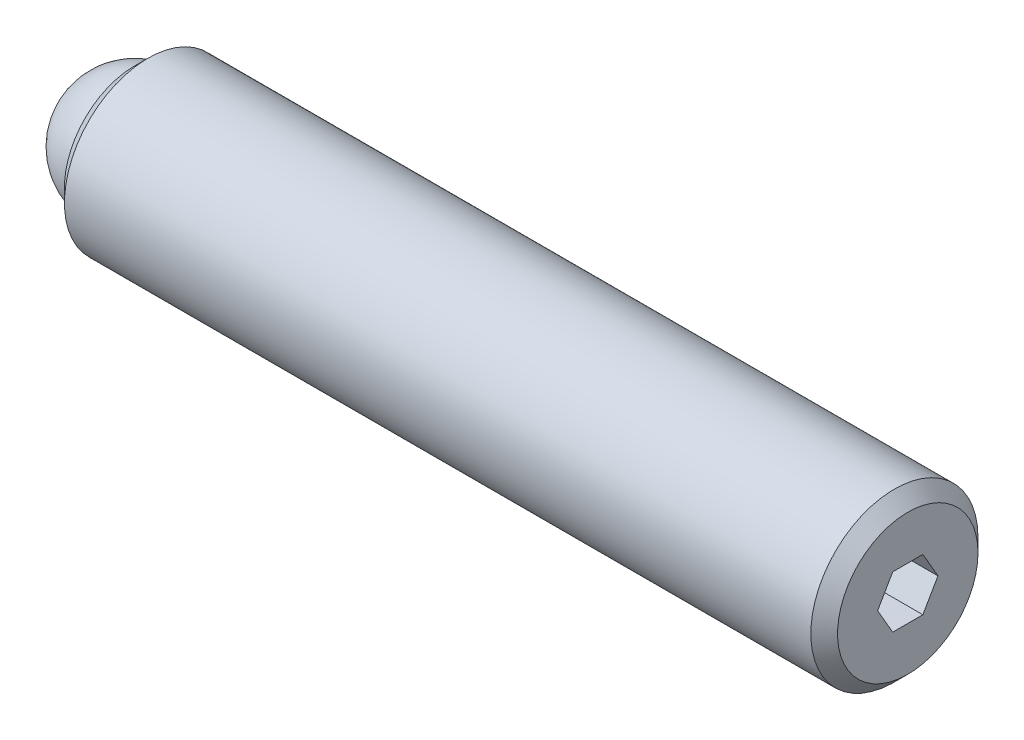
from build123d import *

# Parameters (mm, degrees)
SKETCH2_R           = 3.175
BOSS_EXTRUDE1_DEPTH = 29.36875
CHAMFER1_SIZE       = 0.508
CHAMFER2_SIZE       = 0.508
CUT_EXTRUDE2_DEPTH  = 2.286
SKETCH3_R           = 2.38125
CUT_EXTRUDE3_DEPTH  = 1.984375


with BuildPart() as part:
    # Sketch2 → Boss-Extrude1 (new body)
    with BuildSketch(Plane(origin=(0, 0, 0), x_dir=(0, 0, -1), z_dir=(1, 0, 0))):
        Circle(SKETCH2_R)
    extrude(amount=BOSS_EXTRUDE1_DEPTH)

    # Chamfer1
    chamfer1_edges = [part.edges().sort_by_distance(p)[0] for p in [
        (0, 0, 3.175),
    ]]
    chamfer(chamfer1_edges, length=CHAMFER1_SIZE)

    # Chamfer2
    chamfer2_edges = [part.edges().sort_by_distance(p)[0] for p in [
        (29.36875, 0, 3.175),
    ]]
    chamfer(chamfer2_edges, length=CHAMFER2_SIZE)

    # Sketch4 → Cut-Extrude2 (cut)
    with BuildSketch(Plane(origin=(29.36875, 0, 0), x_dir=(0, 0, -1), z_dir=(1, 0, 0))):
        Polygon((1.14567944, 0), (0.57283972, 0.9921875), (-0.57283972, 0.9921875), (-1.14567944, 0), (-0.57283972, -0.9921875), (0.57283972, -0.9921875), align=None)
    extrude(amount=-CUT_EXTRUDE2_DEPTH, mode=Mode.SUBTRACT)

    # Sketch3 → Cut-Extrude3 (cut)
    with BuildSketch(Plane.ZY):
        Circle(SKETCH3_R)
    extrude(amount=-CUT_EXTRUDE3_DEPTH, mode=Mode.SUBTRACT)


with BuildPart() as body_2:
    # Sketch5 → Revolve1 (revolve)
    with BuildSketch(Plane.ZY):
        with BuildLine():
            Line((0, 0), (0, -2.38125))
            ThreePointArc((0, -2.38125), (-2.38125, 0), (0, 2.38125))
            Line((0, 2.38125), (0, 0))
        make_face()
    revolve(axis=Axis((0, 0, 0), (0, 1, 0)))


solid = Compound([part.part, body_2.part])
